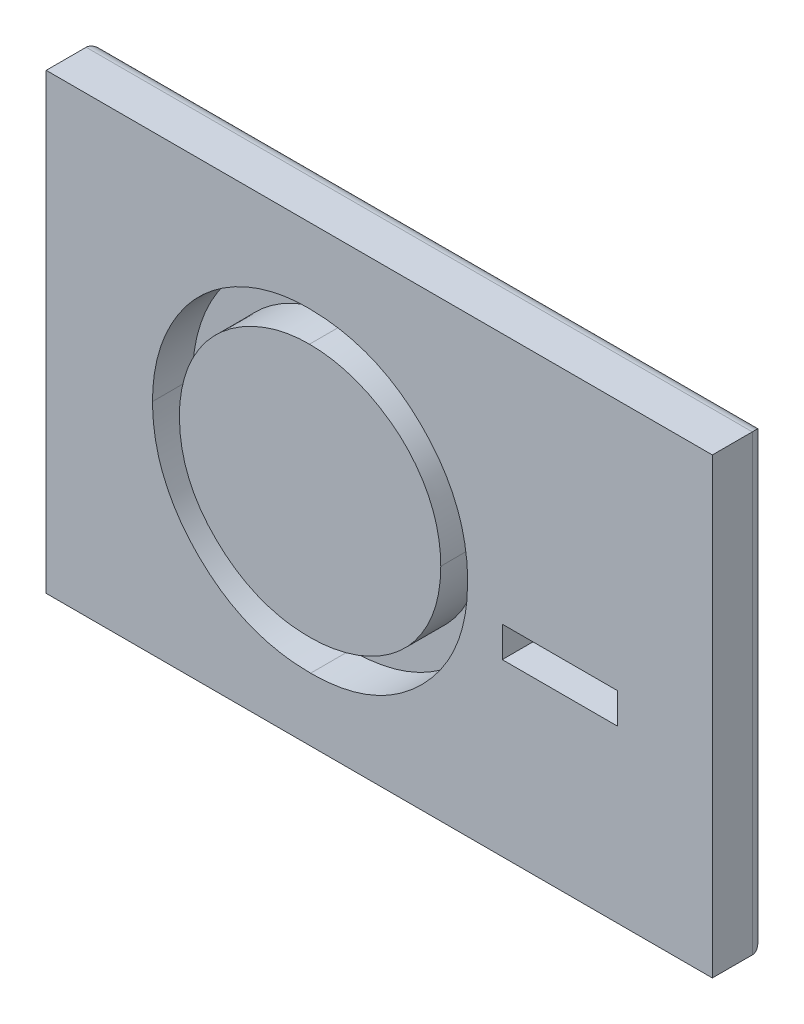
ISO-10303-21;
HEADER;
FILE_DESCRIPTION(('STEP AP214'),'2;1');
FILE_NAME('part.step','',(''),(''),'','','');
FILE_SCHEMA(('AUTOMOTIVE_DESIGN { 1 0 10303 214 1 1 1 1 }'));
ENDSEC;
DATA;
#1=APPLICATION_CONTEXT('core data for automotive mechanical design processes');
#2=APPLICATION_PROTOCOL_DEFINITION('international standard','automotive_design',2000,#1);
#3=PRODUCT_CONTEXT('',#1,'mechanical');
#4=PRODUCT('Part','Part','',(#3));
#5=PRODUCT_RELATED_PRODUCT_CATEGORY('part','',(#4));
#6=PRODUCT_DEFINITION_FORMATION('','',#4);
#7=PRODUCT_DEFINITION_CONTEXT('part definition',#1,'design');
#8=PRODUCT_DEFINITION('design','',#6,#7);
#9=PRODUCT_DEFINITION_SHAPE('','',#8);
#10=(LENGTH_UNIT() NAMED_UNIT(*) SI_UNIT(.MILLI.,.METRE.));
#11=(NAMED_UNIT(*) PLANE_ANGLE_UNIT() SI_UNIT($,.RADIAN.));
#12=(NAMED_UNIT(*) SI_UNIT($,.STERADIAN.) SOLID_ANGLE_UNIT());
#13=UNCERTAINTY_MEASURE_WITH_UNIT(LENGTH_MEASURE(1.E-05),#10,'distance_accuracy_value','');
#14=(GEOMETRIC_REPRESENTATION_CONTEXT(3) GLOBAL_UNCERTAINTY_ASSIGNED_CONTEXT((#13)) GLOBAL_UNIT_ASSIGNED_CONTEXT((#10,
#11,#12)) REPRESENTATION_CONTEXT('',''));
#15=CARTESIAN_POINT('',(0.,0.,0.));
#16=DIRECTION('',(0.,0.,1.));
#17=DIRECTION('',(1.,0.,0.));
#18=AXIS2_PLACEMENT_3D('',#15,#16,#17);
#19=CARTESIAN_POINT('',(0.,0.,2.54));
#20=DIRECTION('',(0.,0.,-1.));
#21=DIRECTION('',(-1.,0.,0.));
#22=AXIS2_PLACEMENT_3D('',#19,#20,#21);
#23=PLANE('',#22);
#24=DIRECTION('',(0.,1.,0.));
#25=VECTOR('',#24,1.);
#26=CARTESIAN_POINT('',(5.86153846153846,-2.66023079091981,2.54));
#27=LINE('',#26,#25);
#28=CARTESIAN_POINT('',(5.86153846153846,-2.66023079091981,2.54));
#29=VERTEX_POINT('',#28);
#30=CARTESIAN_POINT('',(5.86153846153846,-1.19484617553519,2.54));
#31=VERTEX_POINT('',#30);
#32=EDGE_CURVE('E304',#29,#31,#27,.T.);
#33=ORIENTED_EDGE('',*,*,#32,.T.);
#34=DIRECTION('',(1.,0.,0.));
#35=VECTOR('',#34,1.);
#36=CARTESIAN_POINT('',(5.86153846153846,-1.19484617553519,2.54));
#37=LINE('',#36,#35);
#38=CARTESIAN_POINT('',(11.3567307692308,-1.19484617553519,2.54));
#39=VERTEX_POINT('',#38);
#40=EDGE_CURVE('E308',#31,#39,#37,.T.);
#41=ORIENTED_EDGE('',*,*,#40,.T.);
#42=DIRECTION('',(0.,-1.,0.));
#43=VECTOR('',#42,1.);
#44=CARTESIAN_POINT('',(11.3567307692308,-1.19484617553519,2.54));
#45=LINE('',#44,#43);
#46=CARTESIAN_POINT('',(11.3567307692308,-2.66023079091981,2.54));
#47=VERTEX_POINT('',#46);
#48=EDGE_CURVE('E312',#39,#47,#45,.T.);
#49=ORIENTED_EDGE('',*,*,#48,.T.);
#50=DIRECTION('',(-1.,0.,0.));
#51=VECTOR('',#50,1.);
#52=CARTESIAN_POINT('',(11.3567307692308,-2.66023079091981,2.54));
#53=LINE('',#52,#51);
#54=EDGE_CURVE('E294',#47,#29,#53,.T.);
#55=ORIENTED_EDGE('',*,*,#54,.T.);
#56=EDGE_LOOP('',(#33,#41,#49,#55));
#57=FACE_BOUND('',#56,.T.);
#58=DIRECTION('',(0.,1.,0.));
#59=VECTOR('',#58,1.);
#60=CARTESIAN_POINT('',(15.875,-10.795,2.54));
#61=LINE('',#60,#59);
#62=CARTESIAN_POINT('',(15.875,-10.795,2.54));
#63=VERTEX_POINT('',#62);
#64=CARTESIAN_POINT('',(15.875,10.795,2.54));
#65=VERTEX_POINT('',#64);
#66=EDGE_CURVE('E333',#63,#65,#61,.T.);
#67=ORIENTED_EDGE('',*,*,#66,.T.);
#68=DIRECTION('',(-1.,0.,0.));
#69=VECTOR('',#68,1.);
#70=CARTESIAN_POINT('',(-15.875,10.795,2.54));
#71=LINE('',#70,#69);
#72=CARTESIAN_POINT('',(-15.875,10.795,2.54));
#73=VERTEX_POINT('',#72);
#74=EDGE_CURVE('E337',#65,#73,#71,.T.);
#75=ORIENTED_EDGE('',*,*,#74,.T.);
#76=DIRECTION('',(0.,-1.,0.));
#77=VECTOR('',#76,1.);
#78=CARTESIAN_POINT('',(-15.875,-10.795,2.54));
#79=LINE('',#78,#77);
#80=CARTESIAN_POINT('',(-15.875,-10.795,2.54));
#81=VERTEX_POINT('',#80);
#82=EDGE_CURVE('E340',#73,#81,#79,.T.);
#83=ORIENTED_EDGE('',*,*,#82,.T.);
#84=DIRECTION('',(1.,0.,0.));
#85=VECTOR('',#84,1.);
#86=CARTESIAN_POINT('',(-15.875,-10.795,2.54));
#87=LINE('',#86,#85);
#88=EDGE_CURVE('E343',#81,#63,#87,.T.);
#89=ORIENTED_EDGE('',*,*,#88,.T.);
#90=EDGE_LOOP('',(#67,#75,#83,#89));
#91=FACE_BOUND('',#90,.T.);
#92=CARTESIAN_POINT('',(-10.8072115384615,-0.341946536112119,2.54));
#93=CARTESIAN_POINT('',(-10.8050290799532,-0.171996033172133,2.54));
#94=CARTESIAN_POINT('',(-10.8006916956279,0.165760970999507,2.54));
#95=CARTESIAN_POINT('',(-10.7484741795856,0.667319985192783,2.54));
#96=CARTESIAN_POINT('',(-10.6727026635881,1.16081292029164,2.54));
#97=CARTESIAN_POINT('',(-10.5641098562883,1.64483646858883,2.54));
#98=CARTESIAN_POINT('',(-10.4220853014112,2.11820577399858,2.54));
#99=CARTESIAN_POINT('',(-10.2545050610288,2.58418549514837,2.54));
#100=CARTESIAN_POINT('',(-10.0498270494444,3.03805333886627,2.54));
#101=CARTESIAN_POINT('',(-9.81844854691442,3.48195939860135,2.54));
#102=CARTESIAN_POINT('',(-9.56020480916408,3.90898381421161,2.54));
#103=CARTESIAN_POINT('',(-9.27496201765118,4.31262439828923,2.54));
#104=CARTESIAN_POINT('',(-8.97273906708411,4.69626825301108,2.54));
#105=CARTESIAN_POINT('',(-8.6414184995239,5.04997370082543,2.54));
#106=CARTESIAN_POINT('',(-8.29191993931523,5.38403037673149,2.54));
#107=CARTESIAN_POINT('',(-7.91857377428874,5.69330461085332,2.54));
#108=CARTESIAN_POINT('',(-7.52365811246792,5.98058521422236,2.54));
#109=CARTESIAN_POINT('',(-7.10547368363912,6.23947610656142,2.54));
#110=CARTESIAN_POINT('',(-6.67432479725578,6.47362428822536,2.54));
#111=CARTESIAN_POINT('',(-6.22987423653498,6.67455491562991,2.54));
#112=CARTESIAN_POINT('',(-5.77815830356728,6.84700937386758,2.54));
#113=CARTESIAN_POINT('',(-5.31706129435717,6.98678531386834,2.54));
#114=CARTESIAN_POINT('',(-4.84780765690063,7.09713394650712,2.54));
#115=CARTESIAN_POINT('',(-4.36937322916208,7.1722753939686,2.54));
#116=CARTESIAN_POINT('',(-3.88213916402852,7.22462609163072,2.54));
#117=CARTESIAN_POINT('',(-3.5538886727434,7.22894296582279,2.54));
#118=CARTESIAN_POINT('',(-3.38870192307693,7.23111536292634,2.54));
#119=B_SPLINE_CURVE_WITH_KNOTS('',3,(#92,#93,#94,#95,#96,#97,#98,#99,#100,#101,#102,#103,#104,
#105,#106,#107,#108,#109,#110,#111,#112,#113,#114,#115,#116,#117,#118),.UNSPECIFIED.,.F.,.F.,(4,
1,1,1,1,1,1,1,1,1,1,1,1,1,1,1,1,1,1,1,1,1,1,1,4),(0.,0.0432089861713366,0.0858728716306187,
0.128120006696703,0.170151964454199,0.211917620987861,0.253753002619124,0.29600640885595,
0.338443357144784,0.381015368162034,0.422820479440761,0.464089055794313,0.505125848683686,
0.545974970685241,0.58698521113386,0.628338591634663,0.670083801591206,0.711991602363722,
0.753039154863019,0.794049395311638,0.834885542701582,0.875498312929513,0.916547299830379,
0.958003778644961,1.),.UNSPECIFIED.);
#120=CARTESIAN_POINT('',(-10.8072115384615,-0.341946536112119,2.54));
#121=VERTEX_POINT('',#120);
#122=CARTESIAN_POINT('',(-3.38870192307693,7.23111536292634,2.54));
#123=VERTEX_POINT('',#122);
#124=EDGE_CURVE('E56',#121,#123,#119,.T.);
#125=ORIENTED_EDGE('',*,*,#124,.T.);
#126=CARTESIAN_POINT('',(-3.38870192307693,7.23111536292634,2.54));
#127=CARTESIAN_POINT('',(-3.12414597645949,7.2244146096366,2.54));
#128=CARTESIAN_POINT('',(-2.60453627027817,7.21125377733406,2.54));
#129=CARTESIAN_POINT('',(-1.84086981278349,7.11051015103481,2.54));
#130=CARTESIAN_POINT('',(-1.11181912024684,6.93622146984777,2.54));
#131=CARTESIAN_POINT('',(-0.411445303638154,6.70409865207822,2.54));
#132=CARTESIAN_POINT('',(0.251874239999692,6.39445021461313,2.54));
#133=CARTESIAN_POINT('',(0.883132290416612,6.02017834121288,2.54));
#134=CARTESIAN_POINT('',(1.48082688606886,5.57736193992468,2.54));
#135=CARTESIAN_POINT('',(2.03690202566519,5.0694240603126,2.54));
#136=CARTESIAN_POINT('',(2.54576950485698,4.51676946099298,2.54));
#137=CARTESIAN_POINT('',(2.99409446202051,3.92698999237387,2.54));
#138=CARTESIAN_POINT('',(3.36982425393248,3.30365166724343,2.54));
#139=CARTESIAN_POINT('',(3.67837623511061,2.64862763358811,2.54));
#140=CARTESIAN_POINT('',(3.92044163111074,1.96339926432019,2.54));
#141=CARTESIAN_POINT('',(4.08747901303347,1.24431346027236,2.54));
#142=CARTESIAN_POINT('',(4.1941786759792,0.496029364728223,2.54));
#143=CARTESIAN_POINT('',(4.20665279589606,-0.0143481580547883,2.54));
#144=CARTESIAN_POINT('',(4.21298076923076,-0.273256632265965,2.54));
#145=B_SPLINE_CURVE_WITH_KNOTS('',3,(#126,#127,#128,#129,#130,#131,#132,#133,#134,#135,#136,
#137,#138,#139,#140,#141,#142,#143,#144),.UNSPECIFIED.,.F.,.F.,(4,1,1,1,1,1,1,1,1,1,1,1,1,1,1,1,
4),(0.,0.0665700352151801,0.130749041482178,0.193412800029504,0.254989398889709,0.3161135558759,
0.377261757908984,0.439400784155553,0.502970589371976,0.566524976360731,0.628231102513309,
0.689090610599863,0.749344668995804,0.810169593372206,0.871609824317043,0.934869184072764,1.),.UNSPECIFIED.);
#146=CARTESIAN_POINT('',(4.21298076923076,-0.273256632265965,2.54));
#147=VERTEX_POINT('',#146);
#148=EDGE_CURVE('E246',#123,#147,#145,.T.);
#149=ORIENTED_EDGE('',*,*,#148,.T.);
#150=CARTESIAN_POINT('',(4.21298076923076,-0.273256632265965,2.54));
#151=CARTESIAN_POINT('',(4.20665372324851,-0.530257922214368,2.54));
#152=CARTESIAN_POINT('',(4.19418238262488,-1.03683723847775,2.54));
#153=CARTESIAN_POINT('',(4.08735769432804,-1.78037279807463,2.54));
#154=CARTESIAN_POINT('',(3.91982246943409,-2.49511803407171,2.54));
#155=CARTESIAN_POINT('',(3.6806241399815,-3.17987975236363,2.54));
#156=CARTESIAN_POINT('',(3.37354299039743,-3.83538030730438,2.54));
#157=CARTESIAN_POINT('',(2.9953113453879,-4.45989490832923,2.54));
#158=CARTESIAN_POINT('',(2.54978133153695,-5.05362829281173,2.54));
#159=CARTESIAN_POINT('',(2.04275122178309,-5.61007606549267,2.54));
#160=CARTESIAN_POINT('',(1.49002482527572,-6.12033359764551,2.54));
#161=CARTESIAN_POINT('',(0.897174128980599,-6.56495600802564,2.54));
#162=CARTESIAN_POINT('',(0.277532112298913,-6.94755127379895,2.54));
#163=CARTESIAN_POINT('',(-0.37687501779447,-7.25282891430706,2.54));
#164=CARTESIAN_POINT('',(-1.05736838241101,-7.49682643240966,2.54));
#165=CARTESIAN_POINT('',(-1.77003836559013,-7.66318449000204,2.54));
#166=CARTESIAN_POINT('',(-2.51154554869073,-7.77049195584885,2.54));
#167=CARTESIAN_POINT('',(-3.01720468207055,-7.78281396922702,2.54));
#168=CARTESIAN_POINT('',(-3.27421875,-7.78907694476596,2.54));
#169=B_SPLINE_CURVE_WITH_KNOTS('',3,(#150,#151,#152,#153,#154,#155,#156,#157,#158,#159,#160,
#161,#162,#163,#164,#165,#166,#167,#168),.UNSPECIFIED.,.F.,.F.,(4,1,1,1,1,1,1,1,1,1,1,1,1,1,1,1,
4),(0.,0.0652265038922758,0.128568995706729,0.190320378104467,0.251377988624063,
0.312387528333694,0.373788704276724,0.43643115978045,0.500566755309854,0.564686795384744,
0.627135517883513,0.68845540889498,0.749245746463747,0.810155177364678,0.871670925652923,
0.934773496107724,1.),.UNSPECIFIED.);
#170=CARTESIAN_POINT('',(-3.27421875,-7.78907694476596,2.54));
#171=VERTEX_POINT('',#170);
#172=EDGE_CURVE('E255',#147,#171,#169,.T.);
#173=ORIENTED_EDGE('',*,*,#172,.T.);
#174=CARTESIAN_POINT('',(-3.27421875,-7.78907694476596,2.54));
#175=CARTESIAN_POINT('',(-3.53312588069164,-7.78275212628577,2.54));
#176=CARTESIAN_POINT('',(-4.04350075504,-7.77028422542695,2.54));
#177=CARTESIAN_POINT('',(-4.79272515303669,-7.66340799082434,2.54));
#178=CARTESIAN_POINT('',(-5.51231608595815,-7.4962797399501,2.54));
#179=CARTESIAN_POINT('',(-6.2002157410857,-7.2574358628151,2.54));
#180=CARTESIAN_POINT('',(-6.8568077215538,-6.94875552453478,2.54));
#181=CARTESIAN_POINT('',(-7.48337616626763,-6.57236407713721,2.54));
#182=CARTESIAN_POINT('',(-8.07740611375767,-6.1257484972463,2.54));
#183=CARTESIAN_POINT('',(-8.63397260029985,-5.61888280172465,2.54));
#184=CARTESIAN_POINT('',(-9.14321664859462,-5.06709321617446,2.54));
#185=CARTESIAN_POINT('',(-9.58718795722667,-4.4758590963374,2.54));
#186=CARTESIAN_POINT('',(-9.96366404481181,-3.85677985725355,2.54));
#187=CARTESIAN_POINT('',(-10.2713079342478,-3.20813746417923,2.54));
#188=CARTESIAN_POINT('',(-10.5148667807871,-2.53306761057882,2.54));
#189=CARTESIAN_POINT('',(-10.6810296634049,-1.82706721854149,2.54));
#190=CARTESIAN_POINT('',(-10.7885367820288,-1.09416130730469,2.54));
#191=CARTESIAN_POINT('',(-10.8009254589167,-0.595148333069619,2.54));
#192=CARTESIAN_POINT('',(-10.8072115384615,-0.341946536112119,2.54));
#193=B_SPLINE_CURVE_WITH_KNOTS('',3,(#174,#175,#176,#177,#178,#179,#180,#181,#182,#183,#184,
#185,#186,#187,#188,#189,#190,#191,#192),.UNSPECIFIED.,.F.,.F.,(4,1,1,1,1,1,1,1,1,1,1,1,1,1,1,1,
4),(0.,0.0658188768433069,0.129746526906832,0.192071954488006,0.253459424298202,
0.31456958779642,0.376279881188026,0.43902565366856,0.503267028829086,0.567492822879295,
0.629704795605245,0.690999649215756,0.751451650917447,0.812004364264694,0.873149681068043,
0.935635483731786,1.),.UNSPECIFIED.);
#194=EDGE_CURVE('E264',#171,#121,#193,.T.);
#195=ORIENTED_EDGE('',*,*,#194,.T.);
#196=EDGE_LOOP('',(#125,#149,#173,#195));
#197=FACE_BOUND('',#196,.T.);
#198=ADVANCED_FACE('F38',(#57,#91,#197),#23,.F.);
#199=CARTESIAN_POINT('',(15.875,-10.795,2.54));
#200=DIRECTION('',(-1.,0.,0.));
#201=DIRECTION('',(0.,0.,1.));
#202=AXIS2_PLACEMENT_3D('',#199,#200,#201);
#203=PLANE('',#202);
#204=DIRECTION('',(0.,0.,-1.));
#205=VECTOR('',#204,1.);
#206=CARTESIAN_POINT('',(15.875,-10.795,2.54));
#207=LINE('',#206,#205);
#208=CARTESIAN_POINT('',(15.875,-10.795,0.635));
#209=VERTEX_POINT('',#208);
#210=EDGE_CURVE('E346',#63,#209,#207,.T.);
#211=ORIENTED_EDGE('',*,*,#210,.T.);
#212=DIRECTION('',(0.,1.,0.));
#213=VECTOR('',#212,1.);
#214=CARTESIAN_POINT('',(15.875,10.795,0.635));
#215=LINE('',#214,#213);
#216=CARTESIAN_POINT('',(15.875,10.795,0.635));
#217=VERTEX_POINT('',#216);
#218=EDGE_CURVE('E11',#209,#217,#215,.T.);
#219=ORIENTED_EDGE('',*,*,#218,.T.);
#220=DIRECTION('',(0.,0.,-1.));
#221=VECTOR('',#220,1.);
#222=CARTESIAN_POINT('',(15.875,10.795,2.54));
#223=LINE('',#222,#221);
#224=EDGE_CURVE('E358',#65,#217,#223,.T.);
#225=ORIENTED_EDGE('',*,*,#224,.F.);
#226=ORIENTED_EDGE('',*,*,#66,.F.);
#227=EDGE_LOOP('',(#211,#219,#225,#226));
#228=FACE_BOUND('',#227,.T.);
#229=ADVANCED_FACE('F430',(#228),#203,.F.);
#230=CARTESIAN_POINT('',(-15.875,10.795,2.54));
#231=DIRECTION('',(0.,-1.,0.));
#232=DIRECTION('',(0.,0.,-1.));
#233=AXIS2_PLACEMENT_3D('',#230,#231,#232);
#234=PLANE('',#233);
#235=ORIENTED_EDGE('',*,*,#224,.T.);
#236=DIRECTION('',(-1.,0.,0.));
#237=VECTOR('',#236,1.);
#238=CARTESIAN_POINT('',(-15.875,10.795,0.635));
#239=LINE('',#238,#237);
#240=CARTESIAN_POINT('',(-15.875,10.795,0.635));
#241=VERTEX_POINT('',#240);
#242=EDGE_CURVE('E48',#217,#241,#239,.T.);
#243=ORIENTED_EDGE('',*,*,#242,.T.);
#244=DIRECTION('',(0.,0.,-1.));
#245=VECTOR('',#244,1.);
#246=CARTESIAN_POINT('',(-15.875,10.795,2.54));
#247=LINE('',#246,#245);
#248=EDGE_CURVE('E354',#73,#241,#247,.T.);
#249=ORIENTED_EDGE('',*,*,#248,.F.);
#250=ORIENTED_EDGE('',*,*,#74,.F.);
#251=EDGE_LOOP('',(#235,#243,#249,#250));
#252=FACE_BOUND('',#251,.T.);
#253=ADVANCED_FACE('F428',(#252),#234,.F.);
#254=CARTESIAN_POINT('',(-15.875,-10.795,2.54));
#255=DIRECTION('',(1.,0.,0.));
#256=DIRECTION('',(0.,0.,-1.));
#257=AXIS2_PLACEMENT_3D('',#254,#255,#256);
#258=PLANE('',#257);
#259=ORIENTED_EDGE('',*,*,#248,.T.);
#260=DIRECTION('',(0.,-1.,0.));
#261=VECTOR('',#260,1.);
#262=CARTESIAN_POINT('',(-15.875,-10.795,0.635));
#263=LINE('',#262,#261);
#264=CARTESIAN_POINT('',(-15.875,-10.795,0.635));
#265=VERTEX_POINT('',#264);
#266=EDGE_CURVE('E362',#241,#265,#263,.T.);
#267=ORIENTED_EDGE('',*,*,#266,.T.);
#268=DIRECTION('',(0.,0.,-1.));
#269=VECTOR('',#268,1.);
#270=CARTESIAN_POINT('',(-15.875,-10.795,2.54));
#271=LINE('',#270,#269);
#272=EDGE_CURVE('E350',#81,#265,#271,.T.);
#273=ORIENTED_EDGE('',*,*,#272,.F.);
#274=ORIENTED_EDGE('',*,*,#82,.F.);
#275=EDGE_LOOP('',(#259,#267,#273,#274));
#276=FACE_BOUND('',#275,.T.);
#277=ADVANCED_FACE('F418',(#276),#258,.F.);
#278=CARTESIAN_POINT('',(-15.875,-10.795,2.54));
#279=DIRECTION('',(0.,1.,0.));
#280=DIRECTION('',(0.,0.,1.));
#281=AXIS2_PLACEMENT_3D('',#278,#279,#280);
#282=PLANE('',#281);
#283=ORIENTED_EDGE('',*,*,#272,.T.);
#284=DIRECTION('',(1.,0.,0.));
#285=VECTOR('',#284,1.);
#286=CARTESIAN_POINT('',(15.875,-10.795,0.635));
#287=LINE('',#286,#285);
#288=EDGE_CURVE('E379',#265,#209,#287,.T.);
#289=ORIENTED_EDGE('',*,*,#288,.T.);
#290=ORIENTED_EDGE('',*,*,#210,.F.);
#291=ORIENTED_EDGE('',*,*,#88,.F.);
#292=EDGE_LOOP('',(#283,#289,#290,#291));
#293=FACE_BOUND('',#292,.T.);
#294=ADVANCED_FACE('F422',(#293),#282,.F.);
#295=CARTESIAN_POINT('',(0.,0.,0.));
#296=DIRECTION('',(0.,0.,-1.));
#297=DIRECTION('',(-1.,0.,0.));
#298=AXIS2_PLACEMENT_3D('',#295,#296,#297);
#299=PLANE('',#298);
#300=DIRECTION('',(1.,0.,0.));
#301=VECTOR('',#300,1.);
#302=CARTESIAN_POINT('',(-15.875,-10.16,0.));
#303=LINE('',#302,#301);
#304=CARTESIAN_POINT('',(15.24,-10.16,0.));
#305=VERTEX_POINT('',#304);
#306=CARTESIAN_POINT('',(-15.24,-10.16,0.));
#307=VERTEX_POINT('',#306);
#308=EDGE_CURVE('E372',#305,#307,#303,.F.);
#309=ORIENTED_EDGE('',*,*,#308,.T.);
#310=DIRECTION('',(0.,-1.,0.));
#311=VECTOR('',#310,1.);
#312=CARTESIAN_POINT('',(-15.24,10.795,0.));
#313=LINE('',#312,#311);
#314=CARTESIAN_POINT('',(-15.24,10.16,0.));
#315=VERTEX_POINT('',#314);
#316=EDGE_CURVE('E375',#307,#315,#313,.F.);
#317=ORIENTED_EDGE('',*,*,#316,.T.);
#318=DIRECTION('',(-1.,0.,0.));
#319=VECTOR('',#318,1.);
#320=CARTESIAN_POINT('',(15.875,10.16,0.));
#321=LINE('',#320,#319);
#322=CARTESIAN_POINT('',(15.24,10.16,0.));
#323=VERTEX_POINT('',#322);
#324=EDGE_CURVE('E369',#315,#323,#321,.F.);
#325=ORIENTED_EDGE('',*,*,#324,.T.);
#326=DIRECTION('',(0.,1.,0.));
#327=VECTOR('',#326,1.);
#328=CARTESIAN_POINT('',(15.24,-10.795,0.));
#329=LINE('',#328,#327);
#330=EDGE_CURVE('E366',#323,#305,#329,.F.);
#331=ORIENTED_EDGE('',*,*,#330,.T.);
#332=EDGE_LOOP('',(#309,#317,#325,#331));
#333=FACE_BOUND('',#332,.T.);
#334=ADVANCED_FACE('F407',(#333),#299,.T.);
#335=CARTESIAN_POINT('',(15.24,-10.795,0.635));
#336=DIRECTION('',(0.,-1.,0.));
#337=DIRECTION('',(0.,0.,-1.));
#338=AXIS2_PLACEMENT_3D('',#335,#336,#337);
#339=CYLINDRICAL_SURFACE('',#338,0.635);
#340=CARTESIAN_POINT('',(15.24,-10.16,0.635));
#341=DIRECTION('',(-0.707106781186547,-0.707106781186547,0.));
#342=DIRECTION('',(0.707106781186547,-0.707106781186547,0.));
#343=AXIS2_PLACEMENT_3D('',#340,#341,#342);
#344=ELLIPSE('',#343,0.898025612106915,0.635);
#345=EDGE_CURVE('E388',#305,#209,#344,.T.);
#346=ORIENTED_EDGE('',*,*,#345,.F.);
#347=ORIENTED_EDGE('',*,*,#330,.F.);
#348=CARTESIAN_POINT('',(15.24,10.16,0.635));
#349=DIRECTION('',(0.707106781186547,-0.707106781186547,0.));
#350=DIRECTION('',(-0.707106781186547,-0.707106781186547,0.));
#351=AXIS2_PLACEMENT_3D('',#348,#349,#350);
#352=ELLIPSE('',#351,0.898025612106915,0.635);
#353=EDGE_CURVE('E42',#217,#323,#352,.F.);
#354=ORIENTED_EDGE('',*,*,#353,.F.);
#355=ORIENTED_EDGE('',*,*,#218,.F.);
#356=EDGE_LOOP('',(#346,#347,#354,#355));
#357=FACE_BOUND('',#356,.T.);
#358=ADVANCED_FACE('F40',(#357),#339,.T.);
#359=CARTESIAN_POINT('',(-15.875,10.16,0.635));
#360=DIRECTION('',(1.,0.,0.));
#361=DIRECTION('',(0.,0.,-1.));
#362=AXIS2_PLACEMENT_3D('',#359,#360,#361);
#363=CYLINDRICAL_SURFACE('',#362,0.635);
#364=ORIENTED_EDGE('',*,*,#353,.T.);
#365=ORIENTED_EDGE('',*,*,#324,.F.);
#366=CARTESIAN_POINT('',(-15.24,10.16,0.635));
#367=DIRECTION('',(0.707106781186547,0.707106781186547,0.));
#368=DIRECTION('',(0.707106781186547,-0.707106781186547,0.));
#369=AXIS2_PLACEMENT_3D('',#366,#367,#368);
#370=ELLIPSE('',#369,0.898025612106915,0.635);
#371=EDGE_CURVE('E386',#241,#315,#370,.F.);
#372=ORIENTED_EDGE('',*,*,#371,.F.);
#373=ORIENTED_EDGE('',*,*,#242,.F.);
#374=EDGE_LOOP('',(#364,#365,#372,#373));
#375=FACE_BOUND('',#374,.T.);
#376=ADVANCED_FACE('F401',(#375),#363,.T.);
#377=CARTESIAN_POINT('',(-15.875,-10.16,0.635));
#378=DIRECTION('',(-1.,0.,0.));
#379=DIRECTION('',(0.,0.,1.));
#380=AXIS2_PLACEMENT_3D('',#377,#378,#379);
#381=CYLINDRICAL_SURFACE('',#380,0.635);
#382=ORIENTED_EDGE('',*,*,#345,.T.);
#383=ORIENTED_EDGE('',*,*,#288,.F.);
#384=CARTESIAN_POINT('',(-15.24,-10.16,0.635));
#385=DIRECTION('',(-0.707106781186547,0.707106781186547,0.));
#386=DIRECTION('',(-0.707106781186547,-0.707106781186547,0.));
#387=AXIS2_PLACEMENT_3D('',#384,#385,#386);
#388=ELLIPSE('',#387,0.898025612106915,0.635);
#389=EDGE_CURVE('E288',#307,#265,#388,.T.);
#390=ORIENTED_EDGE('',*,*,#389,.F.);
#391=ORIENTED_EDGE('',*,*,#308,.F.);
#392=EDGE_LOOP('',(#382,#383,#390,#391));
#393=FACE_BOUND('',#392,.T.);
#394=ADVANCED_FACE('F413',(#393),#381,.T.);
#395=CARTESIAN_POINT('',(-15.24,-10.795,0.635));
#396=DIRECTION('',(0.,1.,0.));
#397=DIRECTION('',(0.,0.,1.));
#398=AXIS2_PLACEMENT_3D('',#395,#396,#397);
#399=CYLINDRICAL_SURFACE('',#398,0.635);
#400=ORIENTED_EDGE('',*,*,#371,.T.);
#401=ORIENTED_EDGE('',*,*,#316,.F.);
#402=ORIENTED_EDGE('',*,*,#389,.T.);
#403=ORIENTED_EDGE('',*,*,#266,.F.);
#404=EDGE_LOOP('',(#400,#401,#402,#403));
#405=FACE_BOUND('',#404,.T.);
#406=ADVANCED_FACE('F411',(#405),#399,.T.);
#407=CARTESIAN_POINT('',(5.86153846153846,-2.66023079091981,0.635));
#408=DIRECTION('',(1.,0.,0.));
#409=DIRECTION('',(0.,0.,-1.));
#410=AXIS2_PLACEMENT_3D('',#407,#408,#409);
#411=PLANE('',#410);
#412=ORIENTED_EDGE('',*,*,#32,.F.);
#413=DIRECTION('',(0.,0.,1.));
#414=VECTOR('',#413,1.);
#415=CARTESIAN_POINT('',(5.86153846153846,-2.66023079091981,0.635));
#416=LINE('',#415,#414);
#417=CARTESIAN_POINT('',(5.86153846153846,-2.66023079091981,0.635));
#418=VERTEX_POINT('',#417);
#419=EDGE_CURVE('E303',#418,#29,#416,.T.);
#420=ORIENTED_EDGE('',*,*,#419,.F.);
#421=DIRECTION('',(0.,1.,0.));
#422=VECTOR('',#421,1.);
#423=CARTESIAN_POINT('',(5.86153846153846,-2.66023079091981,0.635));
#424=LINE('',#423,#422);
#425=CARTESIAN_POINT('',(5.86153846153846,-1.19484617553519,0.635));
#426=VERTEX_POINT('',#425);
#427=EDGE_CURVE('E289',#418,#426,#424,.T.);
#428=ORIENTED_EDGE('',*,*,#427,.T.);
#429=DIRECTION('',(0.,0.,1.));
#430=VECTOR('',#429,1.);
#431=CARTESIAN_POINT('',(5.86153846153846,-1.19484617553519,0.635));
#432=LINE('',#431,#430);
#433=EDGE_CURVE('E328',#426,#31,#432,.T.);
#434=ORIENTED_EDGE('',*,*,#433,.T.);
#435=EDGE_LOOP('',(#412,#420,#428,#434));
#436=FACE_BOUND('',#435,.T.);
#437=ADVANCED_FACE('F445',(#436),#411,.T.);
#438=CARTESIAN_POINT('',(5.86153846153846,-1.19484617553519,0.635));
#439=DIRECTION('',(0.,-1.,0.));
#440=DIRECTION('',(0.,0.,-1.));
#441=AXIS2_PLACEMENT_3D('',#438,#439,#440);
#442=PLANE('',#441);
#443=ORIENTED_EDGE('',*,*,#40,.F.);
#444=ORIENTED_EDGE('',*,*,#433,.F.);
#445=DIRECTION('',(1.,0.,0.));
#446=VECTOR('',#445,1.);
#447=CARTESIAN_POINT('',(5.86153846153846,-1.19484617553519,0.635));
#448=LINE('',#447,#446);
#449=CARTESIAN_POINT('',(11.3567307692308,-1.19484617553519,0.635));
#450=VERTEX_POINT('',#449);
#451=EDGE_CURVE('E293',#426,#450,#448,.T.);
#452=ORIENTED_EDGE('',*,*,#451,.T.);
#453=DIRECTION('',(0.,0.,1.));
#454=VECTOR('',#453,1.);
#455=CARTESIAN_POINT('',(11.3567307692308,-1.19484617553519,0.635));
#456=LINE('',#455,#454);
#457=EDGE_CURVE('E325',#450,#39,#456,.T.);
#458=ORIENTED_EDGE('',*,*,#457,.T.);
#459=EDGE_LOOP('',(#443,#444,#452,#458));
#460=FACE_BOUND('',#459,.T.);
#461=ADVANCED_FACE('F508',(#460),#442,.T.);
#462=CARTESIAN_POINT('',(11.3567307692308,-1.19484617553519,0.635));
#463=DIRECTION('',(-1.,0.,0.));
#464=DIRECTION('',(0.,0.,1.));
#465=AXIS2_PLACEMENT_3D('',#462,#463,#464);
#466=PLANE('',#465);
#467=ORIENTED_EDGE('',*,*,#48,.F.);
#468=ORIENTED_EDGE('',*,*,#457,.F.);
#469=DIRECTION('',(0.,-1.,0.));
#470=VECTOR('',#469,1.);
#471=CARTESIAN_POINT('',(11.3567307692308,-1.19484617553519,0.635));
#472=LINE('',#471,#470);
#473=CARTESIAN_POINT('',(11.3567307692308,-2.66023079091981,0.635));
#474=VERTEX_POINT('',#473);
#475=EDGE_CURVE('E297',#450,#474,#472,.T.);
#476=ORIENTED_EDGE('',*,*,#475,.T.);
#477=DIRECTION('',(0.,0.,1.));
#478=VECTOR('',#477,1.);
#479=CARTESIAN_POINT('',(11.3567307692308,-2.66023079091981,0.635));
#480=LINE('',#479,#478);
#481=EDGE_CURVE('E322',#474,#47,#480,.T.);
#482=ORIENTED_EDGE('',*,*,#481,.T.);
#483=EDGE_LOOP('',(#467,#468,#476,#482));
#484=FACE_BOUND('',#483,.T.);
#485=ADVANCED_FACE('F517',(#484),#466,.T.);
#486=CARTESIAN_POINT('',(11.3567307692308,-2.66023079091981,0.635));
#487=DIRECTION('',(0.,1.,0.));
#488=DIRECTION('',(0.,0.,1.));
#489=AXIS2_PLACEMENT_3D('',#486,#487,#488);
#490=PLANE('',#489);
#491=ORIENTED_EDGE('',*,*,#54,.F.);
#492=ORIENTED_EDGE('',*,*,#481,.F.);
#493=DIRECTION('',(-1.,0.,0.));
#494=VECTOR('',#493,1.);
#495=CARTESIAN_POINT('',(11.3567307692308,-2.66023079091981,0.635));
#496=LINE('',#495,#494);
#497=EDGE_CURVE('E300',#474,#418,#496,.T.);
#498=ORIENTED_EDGE('',*,*,#497,.T.);
#499=ORIENTED_EDGE('',*,*,#419,.T.);
#500=EDGE_LOOP('',(#491,#492,#498,#499));
#501=FACE_BOUND('',#500,.T.);
#502=ADVANCED_FACE('F527',(#501),#490,.T.);
#503=CARTESIAN_POINT('',(0.,0.,0.635));
#504=DIRECTION('',(0.,0.,-1.));
#505=DIRECTION('',(-1.,0.,0.));
#506=AXIS2_PLACEMENT_3D('',#503,#504,#505);
#507=PLANE('',#506);
#508=ORIENTED_EDGE('',*,*,#427,.F.);
#509=ORIENTED_EDGE('',*,*,#497,.F.);
#510=ORIENTED_EDGE('',*,*,#475,.F.);
#511=ORIENTED_EDGE('',*,*,#451,.F.);
#512=EDGE_LOOP('',(#508,#509,#510,#511));
#513=FACE_BOUND('',#512,.T.);
#514=ADVANCED_FACE('F537',(#513),#507,.F.);
#515=CARTESIAN_POINT('',(-10.8072115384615,-0.341946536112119,0.635));
#516=CARTESIAN_POINT('',(-10.8050290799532,-0.171996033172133,0.635));
#517=CARTESIAN_POINT('',(-10.8006916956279,0.165760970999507,0.635));
#518=CARTESIAN_POINT('',(-10.7484741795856,0.667319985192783,0.635000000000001));
#519=CARTESIAN_POINT('',(-10.6727026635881,1.16081292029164,0.634999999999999));
#520=CARTESIAN_POINT('',(-10.5641098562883,1.64483646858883,0.635000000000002));
#521=CARTESIAN_POINT('',(-10.4220853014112,2.11820577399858,0.635));
#522=CARTESIAN_POINT('',(-10.2545050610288,2.58418549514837,0.635000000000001));
#523=CARTESIAN_POINT('',(-10.0498270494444,3.03805333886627,0.635));
#524=CARTESIAN_POINT('',(-9.81844854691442,3.48195939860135,0.635));
#525=CARTESIAN_POINT('',(-9.56020480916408,3.90898381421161,0.634999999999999));
#526=CARTESIAN_POINT('',(-9.27496201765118,4.31262439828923,0.635));
#527=CARTESIAN_POINT('',(-8.97273906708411,4.69626825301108,0.635000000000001));
#528=CARTESIAN_POINT('',(-8.6414184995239,5.04997370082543,0.635));
#529=CARTESIAN_POINT('',(-8.29191993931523,5.38403037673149,0.635000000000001));
#530=CARTESIAN_POINT('',(-7.91857377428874,5.69330461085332,0.634999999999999));
#531=CARTESIAN_POINT('',(-7.52365811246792,5.98058521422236,0.635000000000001));
#532=CARTESIAN_POINT('',(-7.10547368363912,6.23947610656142,0.635));
#533=CARTESIAN_POINT('',(-6.67432479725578,6.47362428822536,0.635));
#534=CARTESIAN_POINT('',(-6.22987423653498,6.67455491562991,0.635));
#535=CARTESIAN_POINT('',(-5.77815830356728,6.84700937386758,0.635));
#536=CARTESIAN_POINT('',(-5.31706129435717,6.98678531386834,0.635));
#537=CARTESIAN_POINT('',(-4.84780765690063,7.09713394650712,0.635));
#538=CARTESIAN_POINT('',(-4.36937322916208,7.1722753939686,0.635));
#539=CARTESIAN_POINT('',(-3.88213916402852,7.22462609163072,0.635000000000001));
#540=CARTESIAN_POINT('',(-3.5538886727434,7.22894296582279,0.635));
#541=CARTESIAN_POINT('',(-3.38870192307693,7.23111536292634,0.635));
#542=B_SPLINE_CURVE_WITH_KNOTS('',3,(#515,#516,#517,#518,#519,#520,#521,#522,#523,#524,#525,
#526,#527,#528,#529,#530,#531,#532,#533,#534,#535,#536,#537,#538,#539,#540,#541),.UNSPECIFIED.,
.F.,.F.,(4,1,1,1,1,1,1,1,1,1,1,1,1,1,1,1,1,1,1,1,1,1,1,1,4),(0.,0.0432089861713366,
0.0858728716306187,0.128120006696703,0.170151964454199,0.211917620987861,0.253753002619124,
0.29600640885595,0.338443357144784,0.381015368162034,0.422820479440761,0.464089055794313,
0.505125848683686,0.545974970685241,0.58698521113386,0.628338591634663,0.670083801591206,
0.711991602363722,0.753039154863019,0.794049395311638,0.834885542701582,0.875498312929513,
0.916547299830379,0.958003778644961,1.),.UNSPECIFIED.);
#543=DIRECTION('',(0.,0.,1.));
#544=VECTOR('',#543,1.);
#545=SURFACE_OF_LINEAR_EXTRUSION('',#542,#544);
#546=ORIENTED_EDGE('',*,*,#124,.F.);
#547=DIRECTION('',(0.,0.,1.));
#548=VECTOR('',#547,1.);
#549=CARTESIAN_POINT('',(-10.8072115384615,-0.341946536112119,0.635));
#550=LINE('',#549,#548);
#551=CARTESIAN_POINT('',(-10.8072115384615,-0.341946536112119,0.635));
#552=VERTEX_POINT('',#551);
#553=EDGE_CURVE('E233',#552,#121,#550,.T.);
#554=ORIENTED_EDGE('',*,*,#553,.F.);
#555=CARTESIAN_POINT('',(-3.38870192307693,7.23111536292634,0.635));
#556=VERTEX_POINT('',#555);
#557=EDGE_CURVE('E273',#552,#556,#542,.T.);
#558=ORIENTED_EDGE('',*,*,#557,.T.);
#559=DIRECTION('',(0.,0.,1.));
#560=VECTOR('',#559,1.);
#561=CARTESIAN_POINT('',(-3.38870192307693,7.23111536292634,0.635));
#562=LINE('',#561,#560);
#563=EDGE_CURVE('E285',#556,#123,#562,.T.);
#564=ORIENTED_EDGE('',*,*,#563,.T.);
#565=EDGE_LOOP('',(#546,#554,#558,#564));
#566=FACE_BOUND('',#565,.T.);
#567=ADVANCED_FACE('F548',(#566),#545,.T.);
#568=CARTESIAN_POINT('',(-3.38870192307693,7.23111536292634,0.635));
#569=CARTESIAN_POINT('',(-3.12414597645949,7.2244146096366,0.635));
#570=CARTESIAN_POINT('',(-2.60453627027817,7.21125377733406,0.635));
#571=CARTESIAN_POINT('',(-1.84086981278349,7.11051015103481,0.635000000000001));
#572=CARTESIAN_POINT('',(-1.11181912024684,6.93622146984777,0.635));
#573=CARTESIAN_POINT('',(-0.411445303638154,6.70409865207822,0.635));
#574=CARTESIAN_POINT('',(0.251874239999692,6.39445021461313,0.635000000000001));
#575=CARTESIAN_POINT('',(0.883132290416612,6.02017834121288,0.635));
#576=CARTESIAN_POINT('',(1.48082688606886,5.57736193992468,0.635));
#577=CARTESIAN_POINT('',(2.03690202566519,5.0694240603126,0.635000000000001));
#578=CARTESIAN_POINT('',(2.54576950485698,4.51676946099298,0.635000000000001));
#579=CARTESIAN_POINT('',(2.99409446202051,3.92698999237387,0.635000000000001));
#580=CARTESIAN_POINT('',(3.36982425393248,3.30365166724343,0.634999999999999));
#581=CARTESIAN_POINT('',(3.67837623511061,2.64862763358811,0.635000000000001));
#582=CARTESIAN_POINT('',(3.92044163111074,1.96339926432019,0.635));
#583=CARTESIAN_POINT('',(4.08747901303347,1.24431346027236,0.635));
#584=CARTESIAN_POINT('',(4.1941786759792,0.496029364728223,0.635));
#585=CARTESIAN_POINT('',(4.20665279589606,-0.0143481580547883,0.635));
#586=CARTESIAN_POINT('',(4.21298076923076,-0.273256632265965,0.635));
#587=B_SPLINE_CURVE_WITH_KNOTS('',3,(#568,#569,#570,#571,#572,#573,#574,#575,#576,#577,#578,
#579,#580,#581,#582,#583,#584,#585,#586),.UNSPECIFIED.,.F.,.F.,(4,1,1,1,1,1,1,1,1,1,1,1,1,1,1,1,
4),(0.,0.0665700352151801,0.130749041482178,0.193412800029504,0.254989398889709,0.3161135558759,
0.377261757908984,0.439400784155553,0.502970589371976,0.566524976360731,0.628231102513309,
0.689090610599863,0.749344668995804,0.810169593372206,0.871609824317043,0.934869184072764,1.),.UNSPECIFIED.);
#588=DIRECTION('',(0.,0.,1.));
#589=VECTOR('',#588,1.);
#590=SURFACE_OF_LINEAR_EXTRUSION('',#587,#589);
#591=ORIENTED_EDGE('',*,*,#148,.F.);
#592=ORIENTED_EDGE('',*,*,#563,.F.);
#593=CARTESIAN_POINT('',(4.21298076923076,-0.273256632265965,0.635));
#594=VERTEX_POINT('',#593);
#595=EDGE_CURVE('E673',#556,#594,#587,.T.);
#596=ORIENTED_EDGE('',*,*,#595,.T.);
#597=DIRECTION('',(0.,0.,1.));
#598=VECTOR('',#597,1.);
#599=CARTESIAN_POINT('',(4.21298076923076,-0.273256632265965,0.635));
#600=LINE('',#599,#598);
#601=EDGE_CURVE('E282',#594,#147,#600,.T.);
#602=ORIENTED_EDGE('',*,*,#601,.T.);
#603=EDGE_LOOP('',(#591,#592,#596,#602));
#604=FACE_BOUND('',#603,.T.);
#605=ADVANCED_FACE('F559',(#604),#590,.T.);
#606=CARTESIAN_POINT('',(4.21298076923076,-0.273256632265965,0.635));
#607=CARTESIAN_POINT('',(4.20665372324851,-0.530257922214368,0.635));
#608=CARTESIAN_POINT('',(4.19418238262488,-1.03683723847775,0.635));
#609=CARTESIAN_POINT('',(4.08735769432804,-1.78037279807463,0.635000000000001));
#610=CARTESIAN_POINT('',(3.91982246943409,-2.49511803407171,0.635000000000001));
#611=CARTESIAN_POINT('',(3.6806241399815,-3.17987975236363,0.634999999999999));
#612=CARTESIAN_POINT('',(3.37354299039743,-3.83538030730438,0.635000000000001));
#613=CARTESIAN_POINT('',(2.9953113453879,-4.45989490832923,0.635));
#614=CARTESIAN_POINT('',(2.54978133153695,-5.05362829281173,0.635));
#615=CARTESIAN_POINT('',(2.04275122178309,-5.61007606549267,0.635));
#616=CARTESIAN_POINT('',(1.49002482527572,-6.12033359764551,0.635));
#617=CARTESIAN_POINT('',(0.897174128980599,-6.56495600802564,0.635000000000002));
#618=CARTESIAN_POINT('',(0.277532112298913,-6.94755127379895,0.634999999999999));
#619=CARTESIAN_POINT('',(-0.37687501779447,-7.25282891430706,0.635));
#620=CARTESIAN_POINT('',(-1.05736838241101,-7.49682643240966,0.635000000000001));
#621=CARTESIAN_POINT('',(-1.77003836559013,-7.66318449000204,0.634999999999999));
#622=CARTESIAN_POINT('',(-2.51154554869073,-7.77049195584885,0.635000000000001));
#623=CARTESIAN_POINT('',(-3.01720468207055,-7.78281396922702,0.635000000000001));
#624=CARTESIAN_POINT('',(-3.27421875,-7.78907694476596,0.635));
#625=B_SPLINE_CURVE_WITH_KNOTS('',3,(#606,#607,#608,#609,#610,#611,#612,#613,#614,#615,#616,
#617,#618,#619,#620,#621,#622,#623,#624),.UNSPECIFIED.,.F.,.F.,(4,1,1,1,1,1,1,1,1,1,1,1,1,1,1,1,
4),(0.,0.0652265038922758,0.128568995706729,0.190320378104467,0.251377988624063,
0.312387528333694,0.373788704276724,0.43643115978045,0.500566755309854,0.564686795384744,
0.627135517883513,0.68845540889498,0.749245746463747,0.810155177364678,0.871670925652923,
0.934773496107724,1.),.UNSPECIFIED.);
#626=DIRECTION('',(0.,0.,1.));
#627=VECTOR('',#626,1.);
#628=SURFACE_OF_LINEAR_EXTRUSION('',#625,#627);
#629=ORIENTED_EDGE('',*,*,#172,.F.);
#630=ORIENTED_EDGE('',*,*,#601,.F.);
#631=CARTESIAN_POINT('',(-3.27421875,-7.78907694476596,0.635));
#632=VERTEX_POINT('',#631);
#633=EDGE_CURVE('E234',#594,#632,#625,.T.);
#634=ORIENTED_EDGE('',*,*,#633,.T.);
#635=DIRECTION('',(0.,0.,1.));
#636=VECTOR('',#635,1.);
#637=CARTESIAN_POINT('',(-3.27421875,-7.78907694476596,0.635));
#638=LINE('',#637,#636);
#639=EDGE_CURVE('E279',#632,#171,#638,.T.);
#640=ORIENTED_EDGE('',*,*,#639,.T.);
#641=EDGE_LOOP('',(#629,#630,#634,#640));
#642=FACE_BOUND('',#641,.T.);
#643=ADVANCED_FACE('F223',(#642),#628,.T.);
#644=CARTESIAN_POINT('',(-3.27421875,-7.78907694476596,0.635));
#645=CARTESIAN_POINT('',(-3.53312588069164,-7.78275212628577,0.635000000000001));
#646=CARTESIAN_POINT('',(-4.04350075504,-7.77028422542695,0.635));
#647=CARTESIAN_POINT('',(-4.79272515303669,-7.66340799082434,0.635000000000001));
#648=CARTESIAN_POINT('',(-5.51231608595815,-7.4962797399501,0.635000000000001));
#649=CARTESIAN_POINT('',(-6.2002157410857,-7.2574358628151,0.634999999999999));
#650=CARTESIAN_POINT('',(-6.8568077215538,-6.94875552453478,0.635));
#651=CARTESIAN_POINT('',(-7.48337616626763,-6.57236407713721,0.635));
#652=CARTESIAN_POINT('',(-8.07740611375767,-6.1257484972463,0.635));
#653=CARTESIAN_POINT('',(-8.63397260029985,-5.61888280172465,0.635));
#654=CARTESIAN_POINT('',(-9.14321664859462,-5.06709321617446,0.635));
#655=CARTESIAN_POINT('',(-9.58718795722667,-4.4758590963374,0.635));
#656=CARTESIAN_POINT('',(-9.96366404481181,-3.85677985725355,0.635000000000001));
#657=CARTESIAN_POINT('',(-10.2713079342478,-3.20813746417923,0.635000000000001));
#658=CARTESIAN_POINT('',(-10.5148667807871,-2.53306761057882,0.635000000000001));
#659=CARTESIAN_POINT('',(-10.6810296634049,-1.82706721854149,0.634999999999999));
#660=CARTESIAN_POINT('',(-10.7885367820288,-1.09416130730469,0.635000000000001));
#661=CARTESIAN_POINT('',(-10.8009254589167,-0.595148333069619,0.635));
#662=CARTESIAN_POINT('',(-10.8072115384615,-0.341946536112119,0.635));
#663=B_SPLINE_CURVE_WITH_KNOTS('',3,(#644,#645,#646,#647,#648,#649,#650,#651,#652,#653,#654,
#655,#656,#657,#658,#659,#660,#661,#662),.UNSPECIFIED.,.F.,.F.,(4,1,1,1,1,1,1,1,1,1,1,1,1,1,1,1,
4),(0.,0.0658188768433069,0.129746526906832,0.192071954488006,0.253459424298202,
0.31456958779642,0.376279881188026,0.43902565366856,0.503267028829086,0.567492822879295,
0.629704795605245,0.690999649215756,0.751451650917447,0.812004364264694,0.873149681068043,
0.935635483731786,1.),.UNSPECIFIED.);
#664=DIRECTION('',(0.,0.,1.));
#665=VECTOR('',#664,1.);
#666=SURFACE_OF_LINEAR_EXTRUSION('',#663,#665);
#667=ORIENTED_EDGE('',*,*,#194,.F.);
#668=ORIENTED_EDGE('',*,*,#639,.F.);
#669=EDGE_CURVE('E227',#632,#552,#663,.T.);
#670=ORIENTED_EDGE('',*,*,#669,.T.);
#671=ORIENTED_EDGE('',*,*,#553,.T.);
#672=EDGE_LOOP('',(#667,#668,#670,#671));
#673=FACE_BOUND('',#672,.T.);
#674=ADVANCED_FACE('F219',(#673),#666,.T.);
#675=CARTESIAN_POINT('',(-8.68015699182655,5.00421872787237,0.635000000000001));
#676=DIRECTION('',(0.,0.,1.));
#677=DIRECTION('',(1.,0.,0.));
#678=AXIS2_PLACEMENT_3D('',#675,#676,#677);
#679=PLANE('',#678);
#680=CARTESIAN_POINT('',(-3.32573617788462,-6.32369232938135,0.635));
#681=CARTESIAN_POINT('',(-3.18445524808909,-6.32175125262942,0.635000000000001));
#682=CARTESIAN_POINT('',(-2.90425273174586,-6.317901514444,0.635000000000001));
#683=CARTESIAN_POINT('',(-2.48748422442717,-6.27912655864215,0.635));
#684=CARTESIAN_POINT('',(-2.07822404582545,-6.21694789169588,0.635));
#685=CARTESIAN_POINT('',(-1.6770462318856,-6.12742382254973,0.635));
#686=CARTESIAN_POINT('',(-1.28440609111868,-6.01538040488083,0.635));
#687=CARTESIAN_POINT('',(-0.898664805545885,-5.88227100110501,0.635));
#688=CARTESIAN_POINT('',(-0.523931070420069,-5.71620451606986,0.635000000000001));
#689=CARTESIAN_POINT('',(-0.155477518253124,-5.53272055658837,0.635));
#690=CARTESIAN_POINT('',(0.197204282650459,-5.32355091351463,0.635));
#691=CARTESIAN_POINT('',(0.533881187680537,-5.09887732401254,0.635000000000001));
#692=CARTESIAN_POINT('',(0.84606706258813,-4.84999470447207,0.634999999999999));
#693=CARTESIAN_POINT('',(1.14156959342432,-4.58744020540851,0.635));
#694=CARTESIAN_POINT('',(1.41763548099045,-4.30591992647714,0.635));
#695=CARTESIAN_POINT('',(1.67239787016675,-4.00579987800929,0.635000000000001));
#696=CARTESIAN_POINT('',(1.90499890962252,-3.68518569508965,0.635));
#697=CARTESIAN_POINT('',(2.11917117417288,-3.34928491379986,0.635));
#698=CARTESIAN_POINT('',(2.31022877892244,-2.99823592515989,0.635));
#699=CARTESIAN_POINT('',(2.47669488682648,-2.63684513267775,0.635000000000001));
#700=CARTESIAN_POINT('',(2.61792117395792,-2.26600241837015,0.635));
#701=CARTESIAN_POINT('',(2.73192932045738,-1.88517289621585,0.635));
#702=CARTESIAN_POINT('',(2.82126890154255,-1.49507985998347,0.635));
#703=CARTESIAN_POINT('',(2.88282728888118,-1.09520099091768,0.635));
#704=CARTESIAN_POINT('',(2.92588752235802,-0.686336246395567,0.635));
#705=CARTESIAN_POINT('',(2.9291331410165,-0.409796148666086,0.635));
#706=CARTESIAN_POINT('',(2.93076923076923,-0.270394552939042,0.635));
#707=B_SPLINE_CURVE_WITH_KNOTS('',3,(#680,#681,#682,#683,#684,#685,#686,#687,#688,#689,#690,
#691,#692,#693,#694,#695,#696,#697,#698,#699,#700,#701,#702,#703,#704,#705,#706),.UNSPECIFIED.,
.F.,.F.,(4,1,1,1,1,1,1,1,1,1,1,1,1,1,1,1,1,1,1,1,1,1,1,1,4),(0.,0.0436332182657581,
0.0865377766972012,0.129177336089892,0.171436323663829,0.213415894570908,0.25526595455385,
0.297369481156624,0.339940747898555,0.382347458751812,0.423952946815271,0.464871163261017,
0.505572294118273,0.546002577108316,0.586567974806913,0.627064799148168,0.668270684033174,
0.709549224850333,0.750428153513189,0.791096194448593,0.832027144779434,0.873135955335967,
0.914610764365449,0.956955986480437,1.),.UNSPECIFIED.);
#708=CARTESIAN_POINT('',(-3.32573617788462,-6.32369232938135,0.635));
#709=VERTEX_POINT('',#708);
#710=CARTESIAN_POINT('',(2.93076923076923,-0.270394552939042,0.635));
#711=VERTEX_POINT('',#710);
#712=EDGE_CURVE('E180',#709,#711,#707,.T.);
#713=ORIENTED_EDGE('',*,*,#712,.F.);
#714=CARTESIAN_POINT('',(-9.525,-0.336222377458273,0.635));
#715=CARTESIAN_POINT('',(-9.51979583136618,-0.542624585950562,0.635000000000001));
#716=CARTESIAN_POINT('',(-9.50955762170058,-0.94868158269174,0.635));
#717=CARTESIAN_POINT('',(-9.41992368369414,-1.54372797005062,0.635000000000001));
#718=CARTESIAN_POINT('',(-9.28185755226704,-2.11558836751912,0.635000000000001));
#719=CARTESIAN_POINT('',(-9.07833265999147,-2.66113373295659,0.635));
#720=CARTESIAN_POINT('',(-8.82380854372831,-3.18505343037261,0.634999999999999));
#721=CARTESIAN_POINT('',(-8.50937377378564,-3.68269972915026,0.635000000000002));
#722=CARTESIAN_POINT('',(-8.13684114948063,-4.15420712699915,0.634999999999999));
#723=CARTESIAN_POINT('',(-7.71367182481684,-4.59628388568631,0.635000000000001));
#724=CARTESIAN_POINT('',(-7.25107234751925,-4.99978657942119,0.635));
#725=CARTESIAN_POINT('',(-6.75985695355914,-5.35396720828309,0.635));
#726=CARTESIAN_POINT('',(-6.24528812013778,-5.65363833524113,0.634999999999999));
#727=CARTESIAN_POINT('',(-5.70602397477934,-5.89777118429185,0.635000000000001));
#728=CARTESIAN_POINT('',(-5.14494348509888,-6.09122286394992,0.635));
#729=CARTESIAN_POINT('',(-4.55843119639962,-6.22380527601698,0.635000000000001));
#730=CARTESIAN_POINT('',(-3.95039414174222,-6.31106293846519,0.635));
#731=CARTESIAN_POINT('',(-3.53593150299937,-6.31944258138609,0.634999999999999));
#732=CARTESIAN_POINT('',(-3.32573617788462,-6.32369232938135,0.635));
#733=B_SPLINE_CURVE_WITH_KNOTS('',3,(#714,#715,#716,#717,#718,#719,#720,#721,#722,#723,#724,
#725,#726,#727,#728,#729,#730,#731,#732),.UNSPECIFIED.,.F.,.F.,(4,1,1,1,1,1,1,1,1,1,1,1,1,1,1,1,
4),(0.,0.0645039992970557,0.12689932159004,0.187746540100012,0.248149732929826,
0.308586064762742,0.369583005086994,0.431826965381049,0.496179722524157,0.56066785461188,
0.623504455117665,0.685260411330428,0.746536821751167,0.808327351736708,0.870486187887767,
0.934316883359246,1.),.UNSPECIFIED.);
#734=CARTESIAN_POINT('',(-9.525,-0.336222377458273,0.635000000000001));
#735=VERTEX_POINT('',#734);
#736=EDGE_CURVE('E190',#735,#709,#733,.T.);
#737=ORIENTED_EDGE('',*,*,#736,.F.);
#738=CARTESIAN_POINT('',(-3.32573617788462,5.76573074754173,0.635000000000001));
#739=CARTESIAN_POINT('',(-3.46132305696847,5.76407792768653,0.635));
#740=CARTESIAN_POINT('',(-3.73120059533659,5.76078808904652,0.635000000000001));
#741=CARTESIAN_POINT('',(-4.13241211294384,5.71745322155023,0.635));
#742=CARTESIAN_POINT('',(-4.52834704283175,5.65569085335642,0.635000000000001));
#743=CARTESIAN_POINT('',(-4.9190871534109,5.5675920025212,0.635));
#744=CARTESIAN_POINT('',(-5.3029975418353,5.4475604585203,0.635000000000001));
#745=CARTESIAN_POINT('',(-5.68365671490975,5.30941703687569,0.635));
#746=CARTESIAN_POINT('',(-6.05759346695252,5.14114665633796,0.635));
#747=CARTESIAN_POINT('',(-6.42357332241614,4.95103022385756,0.635));
#748=CARTESIAN_POINT('',(-6.77837307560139,4.74060016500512,0.635000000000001));
#749=CARTESIAN_POINT('',(-7.11316063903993,4.50803327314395,0.635));
#750=CARTESIAN_POINT('',(-7.42880271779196,4.25878353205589,0.635));
#751=CARTESIAN_POINT('',(-7.72452648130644,3.99226925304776,0.635));
#752=CARTESIAN_POINT('',(-7.99946358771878,3.70713320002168,0.635));
#753=CARTESIAN_POINT('',(-8.25902542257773,3.40769807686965,0.635));
#754=CARTESIAN_POINT('',(-8.49280803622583,3.0854051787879,0.635000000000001));
#755=CARTESIAN_POINT('',(-8.7070616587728,2.748994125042,0.634999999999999));
#756=CARTESIAN_POINT('',(-8.89879109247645,2.39890309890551,0.635));
#757=CARTESIAN_POINT('',(-9.06928323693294,2.03881783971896,0.635));
#758=CARTESIAN_POINT('',(-9.20874560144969,1.66580106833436,0.635000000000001));
#759=CARTESIAN_POINT('',(-9.32248380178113,1.28389963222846,0.635));
#760=CARTESIAN_POINT('',(-9.41678052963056,0.893718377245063,0.635));
#761=CARTESIAN_POINT('',(-9.47651829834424,0.492297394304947,0.635000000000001));
#762=CARTESIAN_POINT('',(-9.52032932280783,0.0816537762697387,0.634999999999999));
#763=CARTESIAN_POINT('',(-9.52343112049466,-0.195857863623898,0.635000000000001));
#764=CARTESIAN_POINT('',(-9.525,-0.336222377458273,0.635));
#765=B_SPLINE_CURVE_WITH_KNOTS('',3,(#738,#739,#740,#741,#742,#743,#744,#745,#746,#747,#748,
#749,#750,#751,#752,#753,#754,#755,#756,#757,#758,#759,#760,#761,#762,#763,#764),.UNSPECIFIED.,
.F.,.F.,(4,1,1,1,1,1,1,1,1,1,1,1,1,1,1,1,1,1,1,1,1,1,1,1,4),(0.,0.0420233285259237,
0.0836449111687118,0.124983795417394,0.166247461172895,0.207701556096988,0.249631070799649,
0.291741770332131,0.334742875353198,0.377460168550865,0.41955631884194,0.461044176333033,
0.502096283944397,0.5428907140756,0.583800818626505,0.624863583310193,0.66622468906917,
0.707399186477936,0.748556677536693,0.78965459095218,0.830739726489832,0.872070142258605,
0.913993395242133,0.956498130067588,1.),.UNSPECIFIED.);
#766=CARTESIAN_POINT('',(-3.32573617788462,5.76573074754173,0.635000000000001));
#767=VERTEX_POINT('',#766);
#768=EDGE_CURVE('E171',#767,#735,#765,.T.);
#769=ORIENTED_EDGE('',*,*,#768,.F.);
#770=CARTESIAN_POINT('',(2.93076923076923,-0.270394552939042,0.635000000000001));
#771=CARTESIAN_POINT('',(2.92913183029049,-0.131946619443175,0.635000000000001));
#772=CARTESIAN_POINT('',(2.9258837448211,0.142690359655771,0.635));
#773=CARTESIAN_POINT('',(2.88284785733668,0.548703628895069,0.635));
#774=CARTESIAN_POINT('',(2.82120386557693,0.945705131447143,0.635));
#775=CARTESIAN_POINT('',(2.73236538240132,1.33213629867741,0.635));
#776=CARTESIAN_POINT('',(2.61786064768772,1.70809563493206,0.635000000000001));
#777=CARTESIAN_POINT('',(2.47667022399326,2.07323003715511,0.635));
#778=CARTESIAN_POINT('',(2.31017880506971,2.42889977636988,0.635000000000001));
#779=CARTESIAN_POINT('',(2.11910094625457,2.77422578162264,0.635));
#780=CARTESIAN_POINT('',(1.90431563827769,3.1055926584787,0.635));
#781=CARTESIAN_POINT('',(1.66961592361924,3.42237679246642,0.635));
#782=CARTESIAN_POINT('',(1.41094952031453,3.71862909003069,0.635000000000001));
#783=CARTESIAN_POINT('',(1.13570685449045,4.00166321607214,0.635));
#784=CARTESIAN_POINT('',(0.83701284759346,4.26544267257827,0.635000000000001));
#785=CARTESIAN_POINT('',(0.516220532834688,4.51005496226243,0.634999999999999));
#786=CARTESIAN_POINT('',(0.177224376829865,4.7414033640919,0.635));
#787=CARTESIAN_POINT('',(-0.18170715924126,4.95010521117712,0.635000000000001));
#788=CARTESIAN_POINT('',(-0.552136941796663,5.14284045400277,0.634999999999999));
#789=CARTESIAN_POINT('',(-0.932241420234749,5.30796722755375,0.635));
#790=CARTESIAN_POINT('',(-1.31771449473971,5.44827912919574,0.635000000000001));
#791=CARTESIAN_POINT('',(-1.70757592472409,5.56795516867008,0.635));
#792=CARTESIAN_POINT('',(-2.1051071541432,5.65534580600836,0.635));
#793=CARTESIAN_POINT('',(-2.50762206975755,5.71750888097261,0.634999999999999));
#794=CARTESIAN_POINT('',(-2.91456378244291,5.76077300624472,0.635000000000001));
#795=CARTESIAN_POINT('',(-3.18824378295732,5.76407292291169,0.635));
#796=CARTESIAN_POINT('',(-3.32573617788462,5.76573074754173,0.635));
#797=B_SPLINE_CURVE_WITH_KNOTS('',3,(#770,#771,#772,#773,#774,#775,#776,#777,#778,#779,#780,
#781,#782,#783,#784,#785,#786,#787,#788,#789,#790,#791,#792,#793,#794,#795,#796),.UNSPECIFIED.,
.F.,.F.,(4,1,1,1,1,1,1,1,1,1,1,1,1,1,1,1,1,1,1,1,1,1,1,1,4),(0.,0.0429150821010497,
0.0851299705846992,0.126473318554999,0.167453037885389,0.207976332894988,0.24824937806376,
0.288749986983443,0.329669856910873,0.370537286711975,0.411128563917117,0.451818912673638,
0.492405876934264,0.533485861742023,0.575263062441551,0.617440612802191,0.660671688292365,
0.703940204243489,0.74686752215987,0.789079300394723,0.831104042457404,0.873237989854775,
0.915165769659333,0.957380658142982,1.),.UNSPECIFIED.);
#798=EDGE_CURVE('E187',#711,#767,#797,.T.);
#799=ORIENTED_EDGE('',*,*,#798,.F.);
#800=EDGE_LOOP('',(#713,#737,#769,#799));
#801=FACE_BOUND('',#800,.T.);
#802=ORIENTED_EDGE('',*,*,#557,.F.);
#803=ORIENTED_EDGE('',*,*,#669,.F.);
#804=ORIENTED_EDGE('',*,*,#633,.F.);
#805=ORIENTED_EDGE('',*,*,#595,.F.);
#806=EDGE_LOOP('',(#802,#803,#804,#805));
#807=FACE_BOUND('',#806,.T.);
#808=ADVANCED_FACE('F185',(#801,#807),#679,.T.);
#809=DIRECTION('',(0.,0.,1.));
#810=VECTOR('',#809,1.);
#811=SURFACE_OF_LINEAR_EXTRUSION('',#797,#810);
#812=CARTESIAN_POINT('',(2.93076923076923,-0.270394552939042,2.54));
#813=CARTESIAN_POINT('',(2.92913183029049,-0.131946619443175,2.54));
#814=CARTESIAN_POINT('',(2.9258837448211,0.142690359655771,2.54));
#815=CARTESIAN_POINT('',(2.88284785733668,0.548703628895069,2.54));
#816=CARTESIAN_POINT('',(2.82120386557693,0.945705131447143,2.54));
#817=CARTESIAN_POINT('',(2.73236538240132,1.33213629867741,2.54));
#818=CARTESIAN_POINT('',(2.61786064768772,1.70809563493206,2.54));
#819=CARTESIAN_POINT('',(2.47667022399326,2.07323003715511,2.54));
#820=CARTESIAN_POINT('',(2.31017880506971,2.42889977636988,2.54));
#821=CARTESIAN_POINT('',(2.11910094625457,2.77422578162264,2.54));
#822=CARTESIAN_POINT('',(1.90431563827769,3.1055926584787,2.54));
#823=CARTESIAN_POINT('',(1.66961592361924,3.42237679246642,2.54));
#824=CARTESIAN_POINT('',(1.41094952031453,3.71862909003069,2.54));
#825=CARTESIAN_POINT('',(1.13570685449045,4.00166321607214,2.54));
#826=CARTESIAN_POINT('',(0.83701284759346,4.26544267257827,2.54));
#827=CARTESIAN_POINT('',(0.516220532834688,4.51005496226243,2.54));
#828=CARTESIAN_POINT('',(0.177224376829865,4.7414033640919,2.54));
#829=CARTESIAN_POINT('',(-0.18170715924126,4.95010521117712,2.54));
#830=CARTESIAN_POINT('',(-0.552136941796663,5.14284045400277,2.54));
#831=CARTESIAN_POINT('',(-0.932241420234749,5.30796722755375,2.54));
#832=CARTESIAN_POINT('',(-1.31771449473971,5.44827912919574,2.54));
#833=CARTESIAN_POINT('',(-1.70757592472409,5.56795516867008,2.54));
#834=CARTESIAN_POINT('',(-2.1051071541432,5.65534580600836,2.54));
#835=CARTESIAN_POINT('',(-2.50762206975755,5.71750888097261,2.54));
#836=CARTESIAN_POINT('',(-2.91456378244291,5.76077300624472,2.54));
#837=CARTESIAN_POINT('',(-3.18824378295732,5.76407292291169,2.54));
#838=CARTESIAN_POINT('',(-3.32573617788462,5.76573074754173,2.54));
#839=B_SPLINE_CURVE_WITH_KNOTS('',3,(#812,#813,#814,#815,#816,#817,#818,#819,#820,#821,#822,
#823,#824,#825,#826,#827,#828,#829,#830,#831,#832,#833,#834,#835,#836,#837,#838),.UNSPECIFIED.,
.F.,.F.,(4,1,1,1,1,1,1,1,1,1,1,1,1,1,1,1,1,1,1,1,1,1,1,1,4),(0.,0.0429150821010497,
0.0851299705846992,0.126473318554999,0.167453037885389,0.207976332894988,0.24824937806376,
0.288749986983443,0.329669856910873,0.370537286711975,0.411128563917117,0.451818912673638,
0.492405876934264,0.533485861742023,0.575263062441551,0.617440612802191,0.660671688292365,
0.703940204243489,0.74686752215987,0.789079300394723,0.831104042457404,0.873237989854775,
0.915165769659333,0.957380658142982,1.),.UNSPECIFIED.);
#840=CARTESIAN_POINT('',(2.93076923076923,-0.270394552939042,2.54));
#841=VERTEX_POINT('',#840);
#842=CARTESIAN_POINT('',(-3.32573617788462,5.76573074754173,2.54));
#843=VERTEX_POINT('',#842);
#844=EDGE_CURVE('E332',#841,#843,#839,.T.);
#845=ORIENTED_EDGE('',*,*,#844,.F.);
#846=DIRECTION('',(0.,0.,1.));
#847=VECTOR('',#846,1.);
#848=CARTESIAN_POINT('',(2.93076923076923,-0.270394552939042,0.635));
#849=LINE('',#848,#847);
#850=EDGE_CURVE('E194',#711,#841,#849,.T.);
#851=ORIENTED_EDGE('',*,*,#850,.F.);
#852=ORIENTED_EDGE('',*,*,#798,.T.);
#853=DIRECTION('',(0.,0.,1.));
#854=VECTOR('',#853,1.);
#855=CARTESIAN_POINT('',(-3.32573617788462,5.76573074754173,0.635000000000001));
#856=LINE('',#855,#854);
#857=EDGE_CURVE('E168',#767,#843,#856,.T.);
#858=ORIENTED_EDGE('',*,*,#857,.T.);
#859=EDGE_LOOP('',(#845,#851,#852,#858));
#860=FACE_BOUND('',#859,.T.);
#861=ADVANCED_FACE('F193',(#860),#811,.T.);
#862=DIRECTION('',(0.,0.,1.));
#863=VECTOR('',#862,1.);
#864=SURFACE_OF_LINEAR_EXTRUSION('',#707,#863);
#865=CARTESIAN_POINT('',(-3.32573617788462,-6.32369232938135,2.54));
#866=CARTESIAN_POINT('',(-3.18445524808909,-6.32175125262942,2.54));
#867=CARTESIAN_POINT('',(-2.90425273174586,-6.317901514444,2.54));
#868=CARTESIAN_POINT('',(-2.48748422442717,-6.27912655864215,2.54));
#869=CARTESIAN_POINT('',(-2.07822404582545,-6.21694789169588,2.54));
#870=CARTESIAN_POINT('',(-1.6770462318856,-6.12742382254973,2.54));
#871=CARTESIAN_POINT('',(-1.28440609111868,-6.01538040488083,2.54));
#872=CARTESIAN_POINT('',(-0.898664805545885,-5.88227100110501,2.54));
#873=CARTESIAN_POINT('',(-0.523931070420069,-5.71620451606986,2.54));
#874=CARTESIAN_POINT('',(-0.155477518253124,-5.53272055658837,2.54));
#875=CARTESIAN_POINT('',(0.197204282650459,-5.32355091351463,2.54));
#876=CARTESIAN_POINT('',(0.533881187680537,-5.09887732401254,2.54));
#877=CARTESIAN_POINT('',(0.84606706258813,-4.84999470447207,2.54));
#878=CARTESIAN_POINT('',(1.14156959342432,-4.58744020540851,2.54));
#879=CARTESIAN_POINT('',(1.41763548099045,-4.30591992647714,2.54));
#880=CARTESIAN_POINT('',(1.67239787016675,-4.00579987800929,2.54));
#881=CARTESIAN_POINT('',(1.90499890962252,-3.68518569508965,2.54));
#882=CARTESIAN_POINT('',(2.11917117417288,-3.34928491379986,2.54));
#883=CARTESIAN_POINT('',(2.31022877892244,-2.99823592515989,2.54));
#884=CARTESIAN_POINT('',(2.47669488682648,-2.63684513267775,2.54));
#885=CARTESIAN_POINT('',(2.61792117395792,-2.26600241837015,2.54));
#886=CARTESIAN_POINT('',(2.73192932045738,-1.88517289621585,2.54));
#887=CARTESIAN_POINT('',(2.82126890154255,-1.49507985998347,2.54));
#888=CARTESIAN_POINT('',(2.88282728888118,-1.09520099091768,2.54));
#889=CARTESIAN_POINT('',(2.92588752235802,-0.686336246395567,2.54));
#890=CARTESIAN_POINT('',(2.9291331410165,-0.409796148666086,2.54));
#891=CARTESIAN_POINT('',(2.93076923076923,-0.270394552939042,2.54));
#892=B_SPLINE_CURVE_WITH_KNOTS('',3,(#865,#866,#867,#868,#869,#870,#871,#872,#873,#874,#875,
#876,#877,#878,#879,#880,#881,#882,#883,#884,#885,#886,#887,#888,#889,#890,#891),.UNSPECIFIED.,
.F.,.F.,(4,1,1,1,1,1,1,1,1,1,1,1,1,1,1,1,1,1,1,1,1,1,1,1,4),(0.,0.0436332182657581,
0.0865377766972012,0.129177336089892,0.171436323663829,0.213415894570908,0.25526595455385,
0.297369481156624,0.339940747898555,0.382347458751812,0.423952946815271,0.464871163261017,
0.505572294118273,0.546002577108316,0.586567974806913,0.627064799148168,0.668270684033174,
0.709549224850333,0.750428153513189,0.791096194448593,0.832027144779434,0.873135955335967,
0.914610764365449,0.956955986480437,1.),.UNSPECIFIED.);
#893=CARTESIAN_POINT('',(-3.32573617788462,-6.32369232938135,2.54));
#894=VERTEX_POINT('',#893);
#895=EDGE_CURVE('E196',#894,#841,#892,.T.);
#896=ORIENTED_EDGE('',*,*,#895,.F.);
#897=DIRECTION('',(0.,0.,1.));
#898=VECTOR('',#897,1.);
#899=CARTESIAN_POINT('',(-3.32573617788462,-6.32369232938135,0.635));
#900=LINE('',#899,#898);
#901=EDGE_CURVE('E663',#709,#894,#900,.T.);
#902=ORIENTED_EDGE('',*,*,#901,.F.);
#903=ORIENTED_EDGE('',*,*,#712,.T.);
#904=ORIENTED_EDGE('',*,*,#850,.T.);
#905=EDGE_LOOP('',(#896,#902,#903,#904));
#906=FACE_BOUND('',#905,.T.);
#907=ADVANCED_FACE('F215',(#906),#864,.T.);
#908=DIRECTION('',(0.,0.,1.));
#909=VECTOR('',#908,1.);
#910=SURFACE_OF_LINEAR_EXTRUSION('',#733,#909);
#911=CARTESIAN_POINT('',(-9.525,-0.336222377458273,2.54));
#912=CARTESIAN_POINT('',(-9.51979583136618,-0.542624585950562,2.54));
#913=CARTESIAN_POINT('',(-9.50955762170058,-0.94868158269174,2.54));
#914=CARTESIAN_POINT('',(-9.41992368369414,-1.54372797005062,2.54));
#915=CARTESIAN_POINT('',(-9.28185755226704,-2.11558836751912,2.54));
#916=CARTESIAN_POINT('',(-9.07833265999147,-2.66113373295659,2.54));
#917=CARTESIAN_POINT('',(-8.82380854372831,-3.18505343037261,2.54));
#918=CARTESIAN_POINT('',(-8.50937377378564,-3.68269972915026,2.54));
#919=CARTESIAN_POINT('',(-8.13684114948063,-4.15420712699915,2.54));
#920=CARTESIAN_POINT('',(-7.71367182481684,-4.59628388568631,2.54));
#921=CARTESIAN_POINT('',(-7.25107234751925,-4.99978657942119,2.54));
#922=CARTESIAN_POINT('',(-6.75985695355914,-5.35396720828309,2.54));
#923=CARTESIAN_POINT('',(-6.24528812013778,-5.65363833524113,2.54));
#924=CARTESIAN_POINT('',(-5.70602397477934,-5.89777118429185,2.54));
#925=CARTESIAN_POINT('',(-5.14494348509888,-6.09122286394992,2.54));
#926=CARTESIAN_POINT('',(-4.55843119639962,-6.22380527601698,2.54));
#927=CARTESIAN_POINT('',(-3.95039414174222,-6.31106293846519,2.54));
#928=CARTESIAN_POINT('',(-3.53593150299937,-6.31944258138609,2.54));
#929=CARTESIAN_POINT('',(-3.32573617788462,-6.32369232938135,2.54));
#930=B_SPLINE_CURVE_WITH_KNOTS('',3,(#911,#912,#913,#914,#915,#916,#917,#918,#919,#920,#921,
#922,#923,#924,#925,#926,#927,#928,#929),.UNSPECIFIED.,.F.,.F.,(4,1,1,1,1,1,1,1,1,1,1,1,1,1,1,1,
4),(0.,0.0645039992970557,0.12689932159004,0.187746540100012,0.248149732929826,
0.308586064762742,0.369583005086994,0.431826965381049,0.496179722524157,0.56066785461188,
0.623504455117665,0.685260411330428,0.746536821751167,0.808327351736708,0.870486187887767,
0.934316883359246,1.),.UNSPECIFIED.);
#931=CARTESIAN_POINT('',(-9.525,-0.336222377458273,2.54));
#932=VERTEX_POINT('',#931);
#933=EDGE_CURVE('E64',#932,#894,#930,.T.);
#934=ORIENTED_EDGE('',*,*,#933,.F.);
#935=DIRECTION('',(0.,0.,1.));
#936=VECTOR('',#935,1.);
#937=CARTESIAN_POINT('',(-9.525,-0.336222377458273,0.635));
#938=LINE('',#937,#936);
#939=EDGE_CURVE('E179',#735,#932,#938,.T.);
#940=ORIENTED_EDGE('',*,*,#939,.F.);
#941=ORIENTED_EDGE('',*,*,#736,.T.);
#942=ORIENTED_EDGE('',*,*,#901,.T.);
#943=EDGE_LOOP('',(#934,#940,#941,#942));
#944=FACE_BOUND('',#943,.T.);
#945=ADVANCED_FACE('F602',(#944),#910,.T.);
#946=DIRECTION('',(0.,0.,1.));
#947=VECTOR('',#946,1.);
#948=SURFACE_OF_LINEAR_EXTRUSION('',#765,#947);
#949=CARTESIAN_POINT('',(-3.32573617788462,5.76573074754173,2.54));
#950=CARTESIAN_POINT('',(-3.46132305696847,5.76407792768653,2.54));
#951=CARTESIAN_POINT('',(-3.73120059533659,5.76078808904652,2.54));
#952=CARTESIAN_POINT('',(-4.13241211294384,5.71745322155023,2.54));
#953=CARTESIAN_POINT('',(-4.52834704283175,5.65569085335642,2.54));
#954=CARTESIAN_POINT('',(-4.9190871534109,5.5675920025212,2.54));
#955=CARTESIAN_POINT('',(-5.3029975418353,5.4475604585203,2.54));
#956=CARTESIAN_POINT('',(-5.68365671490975,5.30941703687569,2.54));
#957=CARTESIAN_POINT('',(-6.05759346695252,5.14114665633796,2.54));
#958=CARTESIAN_POINT('',(-6.42357332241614,4.95103022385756,2.54));
#959=CARTESIAN_POINT('',(-6.77837307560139,4.74060016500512,2.54));
#960=CARTESIAN_POINT('',(-7.11316063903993,4.50803327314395,2.54));
#961=CARTESIAN_POINT('',(-7.42880271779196,4.25878353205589,2.54));
#962=CARTESIAN_POINT('',(-7.72452648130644,3.99226925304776,2.54));
#963=CARTESIAN_POINT('',(-7.99946358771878,3.70713320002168,2.54));
#964=CARTESIAN_POINT('',(-8.25902542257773,3.40769807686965,2.54));
#965=CARTESIAN_POINT('',(-8.49280803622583,3.0854051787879,2.54));
#966=CARTESIAN_POINT('',(-8.7070616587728,2.748994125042,2.54));
#967=CARTESIAN_POINT('',(-8.89879109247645,2.39890309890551,2.54));
#968=CARTESIAN_POINT('',(-9.06928323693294,2.03881783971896,2.54));
#969=CARTESIAN_POINT('',(-9.20874560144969,1.66580106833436,2.54));
#970=CARTESIAN_POINT('',(-9.32248380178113,1.28389963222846,2.54));
#971=CARTESIAN_POINT('',(-9.41678052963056,0.893718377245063,2.54));
#972=CARTESIAN_POINT('',(-9.47651829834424,0.492297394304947,2.54));
#973=CARTESIAN_POINT('',(-9.52032932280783,0.0816537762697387,2.54));
#974=CARTESIAN_POINT('',(-9.52343112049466,-0.195857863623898,2.54));
#975=CARTESIAN_POINT('',(-9.525,-0.336222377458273,2.54));
#976=B_SPLINE_CURVE_WITH_KNOTS('',3,(#949,#950,#951,#952,#953,#954,#955,#956,#957,#958,#959,
#960,#961,#962,#963,#964,#965,#966,#967,#968,#969,#970,#971,#972,#973,#974,#975),.UNSPECIFIED.,
.F.,.F.,(4,1,1,1,1,1,1,1,1,1,1,1,1,1,1,1,1,1,1,1,1,1,1,1,4),(0.,0.0420233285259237,
0.0836449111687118,0.124983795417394,0.166247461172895,0.207701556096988,0.249631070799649,
0.291741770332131,0.334742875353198,0.377460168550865,0.41955631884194,0.461044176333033,
0.502096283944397,0.5428907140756,0.583800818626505,0.624863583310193,0.66622468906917,
0.707399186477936,0.748556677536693,0.78965459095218,0.830739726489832,0.872070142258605,
0.913993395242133,0.956498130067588,1.),.UNSPECIFIED.);
#977=EDGE_CURVE('E173',#843,#932,#976,.T.);
#978=ORIENTED_EDGE('',*,*,#977,.F.);
#979=ORIENTED_EDGE('',*,*,#857,.F.);
#980=ORIENTED_EDGE('',*,*,#768,.T.);
#981=ORIENTED_EDGE('',*,*,#939,.T.);
#982=EDGE_LOOP('',(#978,#979,#980,#981));
#983=FACE_BOUND('',#982,.T.);
#984=ADVANCED_FACE('F170',(#983),#948,.T.);
#985=ORIENTED_EDGE('',*,*,#844,.T.);
#986=ORIENTED_EDGE('',*,*,#977,.T.);
#987=ORIENTED_EDGE('',*,*,#933,.T.);
#988=ORIENTED_EDGE('',*,*,#895,.T.);
#989=EDGE_LOOP('',(#985,#986,#987,#988));
#990=FACE_BOUND('',#989,.T.);
#991=ADVANCED_FACE('F440',(#990),#23,.F.);
#992=CLOSED_SHELL('',(#198,#229,#253,#277,#294,#334,#358,#376,#394,#406,#437,#461,#485,#502,
#514,#567,#605,#643,#674,#808,#861,#907,#945,#984,#991));
#993=MANIFOLD_SOLID_BREP('B2',#992);
#994=ADVANCED_BREP_SHAPE_REPRESENTATION('',(#18,#993),#14);
#995=SHAPE_DEFINITION_REPRESENTATION(#9,#994);
ENDSEC;
END-ISO-10303-21;
